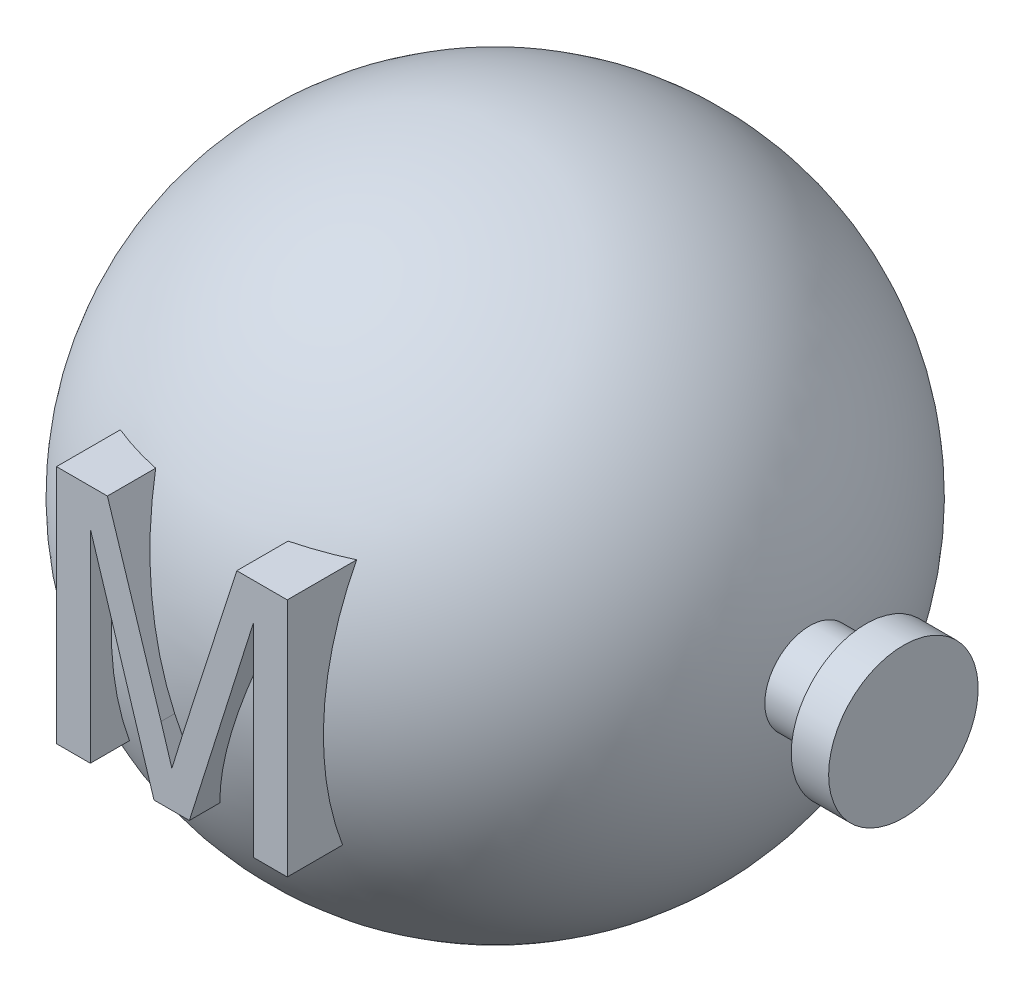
ISO-10303-21;
HEADER;
FILE_DESCRIPTION(('STEP AP214'),'2;1');
FILE_NAME('part.step','',(''),(''),'','','');
FILE_SCHEMA(('AUTOMOTIVE_DESIGN { 1 0 10303 214 1 1 1 1 }'));
ENDSEC;
DATA;
#1=APPLICATION_CONTEXT('core data for automotive mechanical design processes');
#2=APPLICATION_PROTOCOL_DEFINITION('international standard','automotive_design',2000,#1);
#3=PRODUCT_CONTEXT('',#1,'mechanical');
#4=PRODUCT('Part','Part','',(#3));
#5=PRODUCT_RELATED_PRODUCT_CATEGORY('part','',(#4));
#6=PRODUCT_DEFINITION_FORMATION('','',#4);
#7=PRODUCT_DEFINITION_CONTEXT('part definition',#1,'design');
#8=PRODUCT_DEFINITION('design','',#6,#7);
#9=PRODUCT_DEFINITION_SHAPE('','',#8);
#10=(LENGTH_UNIT() NAMED_UNIT(*) SI_UNIT(.MILLI.,.METRE.));
#11=(NAMED_UNIT(*) PLANE_ANGLE_UNIT() SI_UNIT($,.RADIAN.));
#12=(NAMED_UNIT(*) SI_UNIT($,.STERADIAN.) SOLID_ANGLE_UNIT());
#13=UNCERTAINTY_MEASURE_WITH_UNIT(LENGTH_MEASURE(1.E-05),#10,'distance_accuracy_value','');
#14=(GEOMETRIC_REPRESENTATION_CONTEXT(3) GLOBAL_UNCERTAINTY_ASSIGNED_CONTEXT((#13)) GLOBAL_UNIT_ASSIGNED_CONTEXT((#10,
#11,#12)) REPRESENTATION_CONTEXT('',''));
#15=CARTESIAN_POINT('',(0.,0.,0.));
#16=DIRECTION('',(0.,0.,1.));
#17=DIRECTION('',(1.,0.,0.));
#18=AXIS2_PLACEMENT_3D('',#15,#16,#17);
#19=CARTESIAN_POINT('',(0.,0.,0.));
#20=DIRECTION('',(0.,-1.,0.));
#21=DIRECTION('',(-1.,0.,0.));
#22=AXIS2_PLACEMENT_3D('',#19,#20,#21);
#23=SPHERICAL_SURFACE('',#22,85.);
#24=CARTESIAN_POINT('',(-20.1256659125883,0.,0.));
#25=DIRECTION('',(1.,0.,0.));
#26=DIRECTION('',(0.,0.,-1.));
#27=AXIS2_PLACEMENT_3D('',#24,#25,#26);
#28=CIRCLE('',#27,82.5830344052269);
#29=CARTESIAN_POINT('',(-20.1256659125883,26.4211652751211,78.2424411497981));
#30=VERTEX_POINT('',#29);
#31=CARTESIAN_POINT('',(-20.1256659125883,-27.9086530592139,77.7242861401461));
#32=VERTEX_POINT('',#31);
#33=EDGE_CURVE('E40',#30,#32,#28,.T.);
#34=ORIENTED_EDGE('',*,*,#33,.T.);
#35=CARTESIAN_POINT('',(0.,-27.9086530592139,0.));
#36=DIRECTION('',(0.,-1.,0.));
#37=DIRECTION('',(0.,0.,-1.));
#38=AXIS2_PLACEMENT_3D('',#35,#36,#37);
#39=CIRCLE('',#38,80.2876521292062);
#40=CARTESIAN_POINT('',(-29.1806356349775,-27.9086530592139,74.797042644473));
#41=VERTEX_POINT('',#40);
#42=EDGE_CURVE('E11',#32,#41,#39,.T.);
#43=ORIENTED_EDGE('',*,*,#42,.T.);
#44=CARTESIAN_POINT('',(-29.1806356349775,0.,0.));
#45=DIRECTION('',(-1.,0.,0.));
#46=DIRECTION('',(0.,0.,1.));
#47=AXIS2_PLACEMENT_3D('',#44,#45,#46);
#48=CIRCLE('',#47,79.8341437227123);
#49=CARTESIAN_POINT('',(-29.1806356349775,36.299314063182,71.1045026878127));
#50=VERTEX_POINT('',#49);
#51=EDGE_CURVE('E140',#41,#50,#48,.T.);
#52=ORIENTED_EDGE('',*,*,#51,.T.);
#53=CARTESIAN_POINT('',(0.,36.299314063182,0.));
#54=DIRECTION('',(0.,1.,0.));
#55=DIRECTION('',(0.,0.,1.));
#56=AXIS2_PLACEMENT_3D('',#53,#54,#55);
#57=CIRCLE('',#56,76.8593507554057);
#58=CARTESIAN_POINT('',(-15.5595945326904,36.299314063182,75.2679135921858));
#59=VERTEX_POINT('',#58);
#60=EDGE_CURVE('E290',#50,#59,#57,.T.);
#61=ORIENTED_EDGE('',*,*,#60,.T.);
#62=CARTESIAN_POINT('',(-3.62707806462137,-1.15552929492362,0.));
#63=DIRECTION('',(0.95281497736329,0.303551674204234,0.));
#64=DIRECTION('',(-0.303551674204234,0.95281497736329,0.));
#65=AXIS2_PLACEMENT_3D('',#62,#63,#64);
#66=CIRCLE('',#65,84.914716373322);
#67=CARTESIAN_POINT('',(-1.20540957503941,-8.75687760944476,84.5391275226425));
#68=VERTEX_POINT('',#67);
#69=EDGE_CURVE('E198',#59,#68,#66,.T.);
#70=ORIENTED_EDGE('',*,*,#69,.T.);
#71=CARTESIAN_POINT('',(-1.20540957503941,-8.75687760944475,84.5391275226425));
#72=CARTESIAN_POINT('',(-1.1443155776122,-8.95428212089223,84.5195507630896));
#73=CARTESIAN_POINT('',(-1.08324039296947,-9.15161790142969,84.4992163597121));
#74=CARTESIAN_POINT('',(-0.960905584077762,-9.54606919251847,84.457044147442));
#75=CARTESIAN_POINT('',(-0.899645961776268,-9.74318470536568,84.4352063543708));
#76=CARTESIAN_POINT('',(-0.807449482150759,-10.0386376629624,84.4013302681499));
#77=CARTESIAN_POINT('',(-0.776665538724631,-10.1370871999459,84.3898514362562));
#78=CARTESIAN_POINT('',(-0.714961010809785,-10.3338993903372,84.3665225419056));
#79=CARTESIAN_POINT('',(-0.684040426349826,-10.4322620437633,84.3546724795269));
#80=CARTESIAN_POINT('',(-0.591143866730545,-10.7272403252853,84.318562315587));
#81=CARTESIAN_POINT('',(-0.529033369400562,-10.923745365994,84.2937423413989));
#82=CARTESIAN_POINT('',(-0.420344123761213,-11.267760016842,84.2489479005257));
#83=CARTESIAN_POINT('',(-0.373742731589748,-11.415305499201,84.2293027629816));
#84=CARTESIAN_POINT('',(-0.280806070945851,-11.7103632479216,84.1891493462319));
#85=CARTESIAN_POINT('',(-0.234470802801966,-11.8578755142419,84.1686410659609));
#86=CARTESIAN_POINT('',(-0.142161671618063,-12.152890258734,84.1267577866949));
#87=CARTESIAN_POINT('',(-0.0961878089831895,-12.3003927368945,84.1053827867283));
#88=CARTESIAN_POINT('',(-0.00462387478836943,-12.5953884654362,84.0617659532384));
#89=CARTESIAN_POINT('',(0.0409661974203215,-12.7428817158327,84.0395241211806));
#90=CARTESIAN_POINT('',(0.131676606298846,-13.0378796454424,83.9941705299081));
#91=CARTESIAN_POINT('',(0.176796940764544,-13.1853843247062,83.9710587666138));
#92=CARTESIAN_POINT('',(0.266775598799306,-13.4803362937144,83.9239756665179));
#93=CARTESIAN_POINT('',(0.311633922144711,-13.6277835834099,83.9000043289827));
#94=CARTESIAN_POINT('',(0.401416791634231,-13.9225186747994,83.8512174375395));
#95=CARTESIAN_POINT('',(0.446341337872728,-14.0698064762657,83.8264018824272));
#96=CARTESIAN_POINT('',(0.536609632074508,-14.3641118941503,83.7759432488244));
#97=CARTESIAN_POINT('',(0.581953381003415,-14.5111295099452,83.7503001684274));
#98=CARTESIAN_POINT('',(0.672663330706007,-14.8053380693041,83.6981117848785));
#99=CARTESIAN_POINT('',(0.718029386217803,-14.9525287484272,83.6715647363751));
#100=CARTESIAN_POINT('',(0.78560662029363,-15.1733384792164,83.6310870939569));
#101=CARTESIAN_POINT('',(0.808053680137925,-15.2469455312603,83.6174850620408));
#102=CARTESIAN_POINT('',(0.852704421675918,-15.3941919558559,83.590058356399));
#103=CARTESIAN_POINT('',(0.8749081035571,-15.4678313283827,83.5762336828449));
#104=CARTESIAN_POINT('',(0.941245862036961,-15.6887684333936,83.5344301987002));
#105=CARTESIAN_POINT('',(0.985106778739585,-15.8360855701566,83.5061218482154));
#106=CARTESIAN_POINT('',(1.07304460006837,-16.1304931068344,83.4486680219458));
#107=CARTESIAN_POINT('',(1.11712150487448,-16.27758350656,83.4195225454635));
#108=CARTESIAN_POINT('',(1.20636980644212,-16.5712740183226,83.3604341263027));
#109=CARTESIAN_POINT('',(1.25154122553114,-16.7178741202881,83.3304911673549));
#110=CARTESIAN_POINT('',(1.34166186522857,-17.0109653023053,83.2697509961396));
#111=CARTESIAN_POINT('',(1.38661108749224,-17.1574563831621,83.2389537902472));
#112=CARTESIAN_POINT('',(1.45282947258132,-17.3774084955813,83.1920733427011));
#113=CARTESIAN_POINT('',(1.47470101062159,-17.4507605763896,83.1763326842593));
#114=CARTESIAN_POINT('',(1.51809691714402,-17.5975191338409,83.1446258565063));
#115=CARTESIAN_POINT('',(1.53962128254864,-17.67092561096,83.1286596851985));
#116=CARTESIAN_POINT('',(1.58244625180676,-17.817762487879,83.0965060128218));
#117=CARTESIAN_POINT('',(1.6037468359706,-17.8911928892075,83.0803184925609));
#118=CARTESIAN_POINT('',(1.646227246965,-18.0380395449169,83.047728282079));
#119=CARTESIAN_POINT('',(1.6674070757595,-18.111455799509,83.0313255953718));
#120=CARTESIAN_POINT('',(1.68857932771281,-18.1848503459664,83.0148174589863));
#121=B_SPLINE_CURVE_WITH_KNOTS('',3,(#71,#72,#73,#74,#75,#76,#77,#78,#79,#80,#81,#82,#83,#84,
#85,#86,#87,#88,#89,#90,#91,#92,#93,#94,#95,#96,#97,#98,#99,#100,#101,#102,#103,#104,#105,#106,
#107,#108,#109,#110,#111,#112,#113,#114,#115,#116,#117,#118,#119,#120),.UNSPECIFIED.,.F.,.F.,(4,
2,2,2,2,2,2,2,2,2,2,2,2,2,2,2,2,2,2,2,2,2,2,2,4),(0.,0.622702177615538,1.24539780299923,
1.556757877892,1.86811788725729,2.49084077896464,2.95875482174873,3.42666944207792,
3.89458458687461,4.36249894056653,4.83041548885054,5.29833243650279,5.76625005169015,
6.23416874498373,6.70304876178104,6.9374878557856,7.17192676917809,7.64080326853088,
8.10968015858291,8.57856662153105,9.04744958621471,9.28188337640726,9.51631924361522,
9.75077556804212,9.98522806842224),.UNSPECIFIED.);
#122=CARTESIAN_POINT('',(1.68857932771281,-18.1848503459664,83.0148174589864));
#123=VERTEX_POINT('',#122);
#124=EDGE_CURVE('E190',#68,#123,#121,.T.);
#125=ORIENTED_EDGE('',*,*,#124,.T.);
#126=CARTESIAN_POINT('',(1.68857932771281,-18.1848503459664,83.0148174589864));
#127=CARTESIAN_POINT('',(1.72994590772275,-18.044362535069,83.0447506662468));
#128=CARTESIAN_POINT('',(1.77131471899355,-17.9037923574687,83.0742981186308));
#129=CARTESIAN_POINT('',(1.85433311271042,-17.62257202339,83.1325973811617));
#130=CARTESIAN_POINT('',(1.89598269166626,-17.4819218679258,83.1613492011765));
#131=CARTESIAN_POINT('',(1.97983630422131,-17.2006350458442,83.2180313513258));
#132=CARTESIAN_POINT('',(2.02204028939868,-17.0599983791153,83.2459617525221));
#133=CARTESIAN_POINT('',(2.1066432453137,-16.7786294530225,83.3010323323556));
#134=CARTESIAN_POINT('',(2.14904221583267,-16.6378971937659,83.3281725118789));
#135=CARTESIAN_POINT('',(2.21242918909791,-16.4266335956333,83.3683180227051));
#136=CARTESIAN_POINT('',(2.23352220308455,-16.3561873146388,83.3816052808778));
#137=CARTESIAN_POINT('',(2.27557002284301,-16.2152194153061,83.407997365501));
#138=CARTESIAN_POINT('',(2.29652482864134,-16.1446977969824,83.4211021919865));
#139=CARTESIAN_POINT('',(2.35929108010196,-15.9330506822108,83.4601340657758));
#140=CARTESIAN_POINT('',(2.40100413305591,-15.7918436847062,83.4857783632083));
#141=CARTESIAN_POINT('',(2.46398574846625,-15.5800437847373,83.5236289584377));
#142=CARTESIAN_POINT('',(2.48504854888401,-15.5094447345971,83.5361433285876));
#143=CARTESIAN_POINT('',(2.52740362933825,-15.3682780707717,83.5609588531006));
#144=CARTESIAN_POINT('',(2.54869590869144,-15.2977104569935,83.5732600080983));
#145=CARTESIAN_POINT('',(2.59162784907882,-15.1566432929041,83.5976388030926));
#146=CARTESIAN_POINT('',(2.61326750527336,-15.0861437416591,83.6097164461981));
#147=CARTESIAN_POINT('',(2.65689628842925,-14.9452147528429,83.6336477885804));
#148=CARTESIAN_POINT('',(2.67888541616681,-14.8747853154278,83.6455014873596));
#149=CARTESIAN_POINT('',(2.74521425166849,-14.6635589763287,83.6807395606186));
#150=CARTESIAN_POINT('',(2.78991600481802,-14.5228221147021,83.7038012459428));
#151=CARTESIAN_POINT('',(2.87959670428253,-14.2413061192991,83.7491221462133));
#152=CARTESIAN_POINT('',(2.92457565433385,-14.1005269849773,83.7713813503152));
#153=CARTESIAN_POINT('',(3.01402921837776,-13.8186990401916,83.8151628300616));
#154=CARTESIAN_POINT('',(3.0585038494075,-13.6776502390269,83.8366851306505));
#155=CARTESIAN_POINT('',(3.14694500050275,-13.395283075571,83.8789929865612));
#156=CARTESIAN_POINT('',(3.19091151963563,-13.2539647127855,83.8997785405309));
#157=CARTESIAN_POINT('',(3.30053355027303,-12.8995628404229,83.9509284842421));
#158=CARTESIAN_POINT('',(3.36591395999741,-12.686326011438,83.9808215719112));
#159=CARTESIAN_POINT('',(3.49607949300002,-12.2594393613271,84.0388851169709));
#160=CARTESIAN_POINT('',(3.56086462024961,-12.045789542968,84.067055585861));
#161=CARTESIAN_POINT('',(3.69120295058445,-11.6184901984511,84.1215569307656));
#162=CARTESIAN_POINT('',(3.75675614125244,-11.4048406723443,84.1478878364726));
#163=CARTESIAN_POINT('',(3.89001928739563,-10.9779811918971,84.1985885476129));
#164=CARTESIAN_POINT('',(3.95772924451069,-10.7647712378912,84.2229583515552));
#165=CARTESIAN_POINT('',(4.07143586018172,-10.4093634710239,84.2620383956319));
#166=CARTESIAN_POINT('',(4.11716336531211,-10.2671351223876,84.2772653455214));
#167=CARTESIAN_POINT('',(4.20865314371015,-9.98260592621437,84.3069236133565));
#168=CARTESIAN_POINT('',(4.25441541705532,-9.8403050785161,84.3213549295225));
#169=CARTESIAN_POINT('',(4.34554549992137,-9.55550224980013,84.3494585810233));
#170=CARTESIAN_POINT('',(4.39091330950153,-9.41300026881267,84.3631309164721));
#171=CARTESIAN_POINT('',(4.48129521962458,-9.12780887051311,84.3897129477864));
#172=CARTESIAN_POINT('',(4.52630931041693,-8.98511944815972,84.4026226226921));
#173=CARTESIAN_POINT('',(4.61612098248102,-8.69960342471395,84.4276665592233));
#174=CARTESIAN_POINT('',(4.66091856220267,-8.55677682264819,84.4398008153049));
#175=CARTESIAN_POINT('',(4.75041245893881,-8.27102535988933,84.4632835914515));
#176=CARTESIAN_POINT('',(4.795108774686,-8.12810049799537,84.4746321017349));
#177=CARTESIAN_POINT('',(4.83981168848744,-7.98514723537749,84.4855824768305));
#178=B_SPLINE_CURVE_WITH_KNOTS('',3,(#126,#127,#128,#129,#130,#131,#132,#133,#134,#135,#136,
#137,#138,#139,#140,#141,#142,#143,#144,#145,#146,#147,#148,#149,#150,#151,#152,#153,#154,#155,
#156,#157,#158,#159,#160,#161,#162,#163,#164,#165,#166,#167,#168,#169,#170,#171,#172,#173,#174,
#175,#176,#177),.UNSPECIFIED.,.F.,.F.,(4,2,2,2,2,2,2,2,2,2,2,2,2,2,2,2,2,2,2,2,2,2,2,2,2,4),(0.,
0.448438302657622,0.89687104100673,1.34526487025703,1.79365819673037,2.01783926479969,
2.24202028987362,2.69038475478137,2.91457238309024,3.13875934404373,3.36294318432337,
3.58712752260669,4.03549005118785,4.48385863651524,4.93221202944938,5.38056624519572,
6.05564448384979,6.73071821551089,7.4057810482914,8.08084439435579,8.53136042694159,
8.98187746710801,9.4323944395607,9.88292378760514,10.3334563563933,10.7839945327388),.UNSPECIFIED.);
#179=CARTESIAN_POINT('',(4.83981168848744,-7.98514723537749,84.4855824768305));
#180=VERTEX_POINT('',#179);
#181=EDGE_CURVE('E197',#123,#180,#178,.T.);
#182=ORIENTED_EDGE('',*,*,#181,.T.);
#183=CARTESIAN_POINT('',(6.71128920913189,-2.1539281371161,0.));
#184=DIRECTION('',(-0.952163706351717,0.305588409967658,0.));
#185=DIRECTION('',(-0.305588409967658,-0.952163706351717,0.));
#186=AXIS2_PLACEMENT_3D('',#183,#184,#185);
#187=CIRCLE('',#186,84.7072558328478);
#188=CARTESIAN_POINT('',(19.0525127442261,36.299314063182,74.4604697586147));
#189=VERTEX_POINT('',#188);
#190=EDGE_CURVE('E205',#180,#189,#187,.T.);
#191=ORIENTED_EDGE('',*,*,#190,.T.);
#192=CARTESIAN_POINT('',(0.,36.299314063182,0.));
#193=DIRECTION('',(0.,1.,0.));
#194=DIRECTION('',(0.,0.,1.));
#195=AXIS2_PLACEMENT_3D('',#192,#193,#194);
#196=CIRCLE('',#195,76.8593507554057);
#197=CARTESIAN_POINT('',(32.5577942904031,36.299314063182,69.6229116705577));
#198=VERTEX_POINT('',#197);
#199=EDGE_CURVE('E208',#189,#198,#196,.T.);
#200=ORIENTED_EDGE('',*,*,#199,.T.);
#201=CARTESIAN_POINT('',(32.5577942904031,0.,0.));
#202=DIRECTION('',(1.,0.,0.));
#203=DIRECTION('',(0.,0.,-1.));
#204=AXIS2_PLACEMENT_3D('',#201,#202,#203);
#205=CIRCLE('',#204,78.517450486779);
#206=CARTESIAN_POINT('',(32.5577942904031,-27.9086530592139,73.3900341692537));
#207=VERTEX_POINT('',#206);
#208=EDGE_CURVE('E211',#198,#207,#205,.T.);
#209=ORIENTED_EDGE('',*,*,#208,.T.);
#210=CARTESIAN_POINT('',(0.,-27.9086530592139,0.));
#211=DIRECTION('',(0.,-1.,0.));
#212=DIRECTION('',(0.,0.,-1.));
#213=AXIS2_PLACEMENT_3D('',#210,#211,#212);
#214=CIRCLE('',#213,80.2876521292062);
#215=CARTESIAN_POINT('',(23.502824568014,-27.9086530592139,76.7705954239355));
#216=VERTEX_POINT('',#215);
#217=EDGE_CURVE('E214',#207,#216,#214,.T.);
#218=ORIENTED_EDGE('',*,*,#217,.T.);
#219=CARTESIAN_POINT('',(23.502824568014,0.,0.));
#220=DIRECTION('',(-1.,0.,0.));
#221=DIRECTION('',(0.,0.,1.));
#222=AXIS2_PLACEMENT_3D('',#219,#220,#221);
#223=CIRCLE('',#222,81.6860896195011);
#224=CARTESIAN_POINT('',(23.502824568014,26.4211652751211,77.2951438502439));
#225=VERTEX_POINT('',#224);
#226=EDGE_CURVE('E217',#216,#225,#223,.T.);
#227=ORIENTED_EDGE('',*,*,#226,.T.);
#228=CARTESIAN_POINT('',(13.7989811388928,-4.35138325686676,0.));
#229=DIRECTION('',(0.953705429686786,-0.300742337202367,0.));
#230=DIRECTION('',(0.300742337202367,0.953705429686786,0.));
#231=AXIS2_PLACEMENT_3D('',#228,#229,#230);
#232=CIRCLE('',#231,83.7594984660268);
#233=CARTESIAN_POINT('',(6.37041026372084,-27.9086530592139,80.0345235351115));
#234=VERTEX_POINT('',#233);
#235=EDGE_CURVE('E220',#225,#234,#232,.T.);
#236=ORIENTED_EDGE('',*,*,#235,.T.);
#237=CARTESIAN_POINT('',(0.,-27.9086530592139,0.));
#238=DIRECTION('',(0.,-1.,0.));
#239=DIRECTION('',(0.,0.,-1.));
#240=AXIS2_PLACEMENT_3D('',#237,#238,#239);
#241=CIRCLE('',#240,80.2876521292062);
#242=CARTESIAN_POINT('',(-3.09614899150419,-27.9086530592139,80.2279312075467));
#243=VERTEX_POINT('',#242);
#244=EDGE_CURVE('E223',#234,#243,#241,.T.);
#245=ORIENTED_EDGE('',*,*,#244,.T.);
#246=CARTESIAN_POINT('',(-10.7844684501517,-3.38035895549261,0.));
#247=DIRECTION('',(-0.954222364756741,-0.299098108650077,0.));
#248=DIRECTION('',(0.299098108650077,-0.954222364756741,0.));
#249=AXIS2_PLACEMENT_3D('',#246,#247,#248);
#250=CIRCLE('',#249,84.2452871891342);
#251=EDGE_CURVE('E226',#243,#30,#250,.T.);
#252=ORIENTED_EDGE('',*,*,#251,.T.);
#253=EDGE_LOOP('',(#34,#43,#52,#61,#70,#125,#182,#191,#200,#209,#218,#227,#236,#245,#252));
#254=FACE_BOUND('',#253,.T.);
#255=CARTESIAN_POINT('',(84.1486779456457,0.,0.));
#256=DIRECTION('',(-1.,0.,0.));
#257=DIRECTION('',(0.,0.,1.));
#258=AXIS2_PLACEMENT_3D('',#255,#256,#257);
#259=CIRCLE('',#258,12.);
#260=CARTESIAN_POINT('',(84.1486779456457,0.,12.));
#261=VERTEX_POINT('',#260);
#262=EDGE_CURVE('E287',#261,#261,#259,.F.);
#263=ORIENTED_EDGE('',*,*,#262,.F.);
#264=EDGE_LOOP('',(#263));
#265=FACE_BOUND('',#264,.T.);
#266=ADVANCED_FACE('F32',(#254,#265),#23,.T.);
#267=CARTESIAN_POINT('',(0.,0.,0.));
#268=DIRECTION('',(-1.,0.,0.));
#269=DIRECTION('',(0.,0.,1.));
#270=AXIS2_PLACEMENT_3D('',#267,#268,#269);
#271=CYLINDRICAL_SURFACE('',#270,12.);
#272=CARTESIAN_POINT('',(99.2135729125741,0.,0.));
#273=DIRECTION('',(-1.,0.,0.));
#274=DIRECTION('',(0.,0.,1.));
#275=AXIS2_PLACEMENT_3D('',#272,#273,#274);
#276=CIRCLE('',#275,12.);
#277=CARTESIAN_POINT('',(99.2135729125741,0.,12.));
#278=VERTEX_POINT('',#277);
#279=EDGE_CURVE('E243',#278,#278,#276,.T.);
#280=ORIENTED_EDGE('',*,*,#279,.T.);
#281=EDGE_LOOP('',(#280));
#282=FACE_BOUND('',#281,.T.);
#283=ORIENTED_EDGE('',*,*,#262,.T.);
#284=EDGE_LOOP('',(#283));
#285=FACE_BOUND('',#284,.T.);
#286=ADVANCED_FACE('F303',(#282,#285),#271,.T.);
#287=CARTESIAN_POINT('',(109.213572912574,20.,0.));
#288=DIRECTION('',(-1.,0.,0.));
#289=DIRECTION('',(0.,0.,1.));
#290=AXIS2_PLACEMENT_3D('',#287,#288,#289);
#291=PLANE('',#290);
#292=CARTESIAN_POINT('',(109.213572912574,0.,0.));
#293=DIRECTION('',(-1.,0.,0.));
#294=DIRECTION('',(0.,0.,1.));
#295=AXIS2_PLACEMENT_3D('',#292,#293,#294);
#296=CIRCLE('',#295,20.);
#297=CARTESIAN_POINT('',(109.213572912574,0.,20.));
#298=VERTEX_POINT('',#297);
#299=EDGE_CURVE('E284',#298,#298,#296,.T.);
#300=ORIENTED_EDGE('',*,*,#299,.F.);
#301=EDGE_LOOP('',(#300));
#302=FACE_BOUND('',#301,.T.);
#303=ADVANCED_FACE('F307',(#302),#291,.F.);
#304=CARTESIAN_POINT('',(0.,0.,0.));
#305=DIRECTION('',(-1.,0.,0.));
#306=DIRECTION('',(0.,0.,1.));
#307=AXIS2_PLACEMENT_3D('',#304,#305,#306);
#308=CYLINDRICAL_SURFACE('',#307,20.);
#309=CARTESIAN_POINT('',(99.2135729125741,0.,0.));
#310=DIRECTION('',(-1.,0.,0.));
#311=DIRECTION('',(0.,0.,1.));
#312=AXIS2_PLACEMENT_3D('',#309,#310,#311);
#313=CIRCLE('',#312,20.);
#314=CARTESIAN_POINT('',(99.2135729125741,0.,20.));
#315=VERTEX_POINT('',#314);
#316=EDGE_CURVE('E281',#315,#315,#313,.T.);
#317=ORIENTED_EDGE('',*,*,#316,.F.);
#318=EDGE_LOOP('',(#317));
#319=FACE_BOUND('',#318,.T.);
#320=ORIENTED_EDGE('',*,*,#299,.T.);
#321=EDGE_LOOP('',(#320));
#322=FACE_BOUND('',#321,.T.);
#323=ADVANCED_FACE('F313',(#319,#322),#308,.T.);
#324=CARTESIAN_POINT('',(99.2135729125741,12.,0.));
#325=DIRECTION('',(1.,0.,0.));
#326=DIRECTION('',(0.,0.,-1.));
#327=AXIS2_PLACEMENT_3D('',#324,#325,#326);
#328=PLANE('',#327);
#329=ORIENTED_EDGE('',*,*,#279,.F.);
#330=EDGE_LOOP('',(#329));
#331=FACE_BOUND('',#330,.T.);
#332=ORIENTED_EDGE('',*,*,#316,.T.);
#333=EDGE_LOOP('',(#332));
#334=FACE_BOUND('',#333,.T.);
#335=ADVANCED_FACE('F318',(#331,#334),#328,.F.);
#336=CARTESIAN_POINT('',(-20.1256659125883,-27.9086530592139,88.1865879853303));
#337=DIRECTION('',(0.,-1.,0.));
#338=DIRECTION('',(0.,0.,-1.));
#339=AXIS2_PLACEMENT_3D('',#336,#337,#338);
#340=PLANE('',#339);
#341=ORIENTED_EDGE('',*,*,#42,.F.);
#342=DIRECTION('',(0.,0.,-1.));
#343=VECTOR('',#342,1.);
#344=CARTESIAN_POINT('',(-20.1256659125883,-27.9086530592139,88.1865879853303));
#345=LINE('',#344,#343);
#346=CARTESIAN_POINT('',(-20.1256659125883,-27.9086530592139,88.1865879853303));
#347=VERTEX_POINT('',#346);
#348=EDGE_CURVE('E156',#347,#32,#345,.T.);
#349=ORIENTED_EDGE('',*,*,#348,.F.);
#350=DIRECTION('',(-1.,0.,0.));
#351=VECTOR('',#350,1.);
#352=CARTESIAN_POINT('',(-20.1256659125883,-27.9086530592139,88.1865879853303));
#353=LINE('',#352,#351);
#354=CARTESIAN_POINT('',(-29.1806356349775,-27.9086530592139,88.1865879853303));
#355=VERTEX_POINT('',#354);
#356=EDGE_CURVE('E149',#347,#355,#353,.T.);
#357=ORIENTED_EDGE('',*,*,#356,.T.);
#358=DIRECTION('',(0.,0.,-1.));
#359=VECTOR('',#358,1.);
#360=CARTESIAN_POINT('',(-29.1806356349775,-27.9086530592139,88.1865879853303));
#361=LINE('',#360,#359);
#362=EDGE_CURVE('E135',#355,#41,#361,.T.);
#363=ORIENTED_EDGE('',*,*,#362,.T.);
#364=EDGE_LOOP('',(#341,#349,#357,#363));
#365=FACE_BOUND('',#364,.T.);
#366=ADVANCED_FACE('F155',(#365),#340,.T.);
#367=CARTESIAN_POINT('',(-20.1256659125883,26.4211652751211,88.1865879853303));
#368=DIRECTION('',(1.,0.,0.));
#369=DIRECTION('',(0.,0.,-1.));
#370=AXIS2_PLACEMENT_3D('',#367,#368,#369);
#371=PLANE('',#370);
#372=ORIENTED_EDGE('',*,*,#33,.F.);
#373=DIRECTION('',(0.,0.,-1.));
#374=VECTOR('',#373,1.);
#375=CARTESIAN_POINT('',(-20.1256659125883,26.4211652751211,88.1865879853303));
#376=LINE('',#375,#374);
#377=CARTESIAN_POINT('',(-20.1256659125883,26.4211652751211,88.1865879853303));
#378=VERTEX_POINT('',#377);
#379=EDGE_CURVE('E234',#378,#30,#376,.T.);
#380=ORIENTED_EDGE('',*,*,#379,.F.);
#381=DIRECTION('',(0.,-1.,0.));
#382=VECTOR('',#381,1.);
#383=CARTESIAN_POINT('',(-20.1256659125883,26.4211652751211,88.1865879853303));
#384=LINE('',#383,#382);
#385=EDGE_CURVE('E142',#378,#347,#384,.T.);
#386=ORIENTED_EDGE('',*,*,#385,.T.);
#387=ORIENTED_EDGE('',*,*,#348,.T.);
#388=EDGE_LOOP('',(#372,#380,#386,#387));
#389=FACE_BOUND('',#388,.T.);
#390=ADVANCED_FACE('F233',(#389),#371,.T.);
#391=CARTESIAN_POINT('',(-3.09614899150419,-27.9086530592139,88.1865879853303));
#392=DIRECTION('',(-0.954222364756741,-0.299098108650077,0.));
#393=DIRECTION('',(0.299098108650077,-0.954222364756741,0.));
#394=AXIS2_PLACEMENT_3D('',#391,#392,#393);
#395=PLANE('',#394);
#396=ORIENTED_EDGE('',*,*,#251,.F.);
#397=DIRECTION('',(0.,0.,-1.));
#398=VECTOR('',#397,1.);
#399=CARTESIAN_POINT('',(-3.09614899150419,-27.9086530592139,88.1865879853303));
#400=LINE('',#399,#398);
#401=CARTESIAN_POINT('',(-3.09614899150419,-27.9086530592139,88.1865879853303));
#402=VERTEX_POINT('',#401);
#403=EDGE_CURVE('E241',#402,#243,#400,.T.);
#404=ORIENTED_EDGE('',*,*,#403,.F.);
#405=DIRECTION('',(-0.299098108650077,0.954222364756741,0.));
#406=VECTOR('',#405,1.);
#407=CARTESIAN_POINT('',(-3.09614899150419,-27.9086530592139,88.1865879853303));
#408=LINE('',#407,#406);
#409=EDGE_CURVE('E240',#402,#378,#408,.T.);
#410=ORIENTED_EDGE('',*,*,#409,.T.);
#411=ORIENTED_EDGE('',*,*,#379,.T.);
#412=EDGE_LOOP('',(#396,#404,#410,#411));
#413=FACE_BOUND('',#412,.T.);
#414=ADVANCED_FACE('F237',(#413),#395,.T.);
#415=CARTESIAN_POINT('',(6.37041026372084,-27.9086530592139,88.1865879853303));
#416=DIRECTION('',(0.,-1.,0.));
#417=DIRECTION('',(0.,0.,-1.));
#418=AXIS2_PLACEMENT_3D('',#415,#416,#417);
#419=PLANE('',#418);
#420=ORIENTED_EDGE('',*,*,#244,.F.);
#421=DIRECTION('',(0.,0.,-1.));
#422=VECTOR('',#421,1.);
#423=CARTESIAN_POINT('',(6.37041026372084,-27.9086530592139,88.1865879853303));
#424=LINE('',#423,#422);
#425=CARTESIAN_POINT('',(6.37041026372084,-27.9086530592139,88.1865879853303));
#426=VERTEX_POINT('',#425);
#427=EDGE_CURVE('E245',#426,#234,#424,.T.);
#428=ORIENTED_EDGE('',*,*,#427,.F.);
#429=DIRECTION('',(-1.,0.,0.));
#430=VECTOR('',#429,1.);
#431=CARTESIAN_POINT('',(6.37041026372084,-27.9086530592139,88.1865879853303));
#432=LINE('',#431,#430);
#433=EDGE_CURVE('E507',#426,#402,#432,.T.);
#434=ORIENTED_EDGE('',*,*,#433,.T.);
#435=ORIENTED_EDGE('',*,*,#403,.T.);
#436=EDGE_LOOP('',(#420,#428,#434,#435));
#437=FACE_BOUND('',#436,.T.);
#438=ADVANCED_FACE('F353',(#437),#419,.T.);
#439=CARTESIAN_POINT('',(23.502824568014,26.4211652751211,88.1865879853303));
#440=DIRECTION('',(0.953705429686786,-0.300742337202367,0.));
#441=DIRECTION('',(0.300742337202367,0.953705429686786,0.));
#442=AXIS2_PLACEMENT_3D('',#439,#440,#441);
#443=PLANE('',#442);
#444=ORIENTED_EDGE('',*,*,#235,.F.);
#445=DIRECTION('',(0.,0.,-1.));
#446=VECTOR('',#445,1.);
#447=CARTESIAN_POINT('',(23.502824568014,26.4211652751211,88.1865879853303));
#448=LINE('',#447,#446);
#449=CARTESIAN_POINT('',(23.502824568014,26.4211652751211,88.1865879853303));
#450=VERTEX_POINT('',#449);
#451=EDGE_CURVE('E251',#450,#225,#448,.T.);
#452=ORIENTED_EDGE('',*,*,#451,.F.);
#453=DIRECTION('',(-0.300742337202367,-0.953705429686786,0.));
#454=VECTOR('',#453,1.);
#455=CARTESIAN_POINT('',(23.502824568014,26.4211652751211,88.1865879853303));
#456=LINE('',#455,#454);
#457=EDGE_CURVE('E504',#450,#426,#456,.T.);
#458=ORIENTED_EDGE('',*,*,#457,.T.);
#459=ORIENTED_EDGE('',*,*,#427,.T.);
#460=EDGE_LOOP('',(#444,#452,#458,#459));
#461=FACE_BOUND('',#460,.T.);
#462=ADVANCED_FACE('F360',(#461),#443,.T.);
#463=CARTESIAN_POINT('',(23.502824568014,-27.9086530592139,88.1865879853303));
#464=DIRECTION('',(-1.,0.,0.));
#465=DIRECTION('',(0.,0.,1.));
#466=AXIS2_PLACEMENT_3D('',#463,#464,#465);
#467=PLANE('',#466);
#468=ORIENTED_EDGE('',*,*,#226,.F.);
#469=DIRECTION('',(0.,0.,-1.));
#470=VECTOR('',#469,1.);
#471=CARTESIAN_POINT('',(23.502824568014,-27.9086530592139,88.1865879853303));
#472=LINE('',#471,#470);
#473=CARTESIAN_POINT('',(23.502824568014,-27.9086530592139,88.1865879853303));
#474=VERTEX_POINT('',#473);
#475=EDGE_CURVE('E254',#474,#216,#472,.T.);
#476=ORIENTED_EDGE('',*,*,#475,.F.);
#477=DIRECTION('',(0.,1.,0.));
#478=VECTOR('',#477,1.);
#479=CARTESIAN_POINT('',(23.502824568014,-27.9086530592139,88.1865879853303));
#480=LINE('',#479,#478);
#481=EDGE_CURVE('E501',#474,#450,#480,.T.);
#482=ORIENTED_EDGE('',*,*,#481,.T.);
#483=ORIENTED_EDGE('',*,*,#451,.T.);
#484=EDGE_LOOP('',(#468,#476,#482,#483));
#485=FACE_BOUND('',#484,.T.);
#486=ADVANCED_FACE('F368',(#485),#467,.T.);
#487=CARTESIAN_POINT('',(32.5577942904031,-27.9086530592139,88.1865879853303));
#488=DIRECTION('',(0.,-1.,0.));
#489=DIRECTION('',(0.,0.,-1.));
#490=AXIS2_PLACEMENT_3D('',#487,#488,#489);
#491=PLANE('',#490);
#492=ORIENTED_EDGE('',*,*,#217,.F.);
#493=DIRECTION('',(0.,0.,-1.));
#494=VECTOR('',#493,1.);
#495=CARTESIAN_POINT('',(32.5577942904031,-27.9086530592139,88.1865879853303));
#496=LINE('',#495,#494);
#497=CARTESIAN_POINT('',(32.5577942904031,-27.9086530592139,88.1865879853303));
#498=VERTEX_POINT('',#497);
#499=EDGE_CURVE('E257',#498,#207,#496,.T.);
#500=ORIENTED_EDGE('',*,*,#499,.F.);
#501=DIRECTION('',(-1.,0.,0.));
#502=VECTOR('',#501,1.);
#503=CARTESIAN_POINT('',(32.5577942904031,-27.9086530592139,88.1865879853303));
#504=LINE('',#503,#502);
#505=EDGE_CURVE('E498',#498,#474,#504,.T.);
#506=ORIENTED_EDGE('',*,*,#505,.T.);
#507=ORIENTED_EDGE('',*,*,#475,.T.);
#508=EDGE_LOOP('',(#492,#500,#506,#507));
#509=FACE_BOUND('',#508,.T.);
#510=ADVANCED_FACE('F376',(#509),#491,.T.);
#511=CARTESIAN_POINT('',(32.5577942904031,36.299314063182,88.1865879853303));
#512=DIRECTION('',(1.,0.,0.));
#513=DIRECTION('',(0.,0.,-1.));
#514=AXIS2_PLACEMENT_3D('',#511,#512,#513);
#515=PLANE('',#514);
#516=ORIENTED_EDGE('',*,*,#208,.F.);
#517=DIRECTION('',(0.,0.,-1.));
#518=VECTOR('',#517,1.);
#519=CARTESIAN_POINT('',(32.5577942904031,36.299314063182,88.1865879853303));
#520=LINE('',#519,#518);
#521=CARTESIAN_POINT('',(32.5577942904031,36.299314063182,88.1865879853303));
#522=VERTEX_POINT('',#521);
#523=EDGE_CURVE('E260',#522,#198,#520,.T.);
#524=ORIENTED_EDGE('',*,*,#523,.F.);
#525=DIRECTION('',(0.,-1.,0.));
#526=VECTOR('',#525,1.);
#527=CARTESIAN_POINT('',(32.5577942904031,36.299314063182,88.1865879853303));
#528=LINE('',#527,#526);
#529=EDGE_CURVE('E493',#522,#498,#528,.T.);
#530=ORIENTED_EDGE('',*,*,#529,.T.);
#531=ORIENTED_EDGE('',*,*,#499,.T.);
#532=EDGE_LOOP('',(#516,#524,#530,#531));
#533=FACE_BOUND('',#532,.T.);
#534=ADVANCED_FACE('F384',(#533),#515,.T.);
#535=CARTESIAN_POINT('',(19.0525127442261,36.299314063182,88.1865879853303));
#536=DIRECTION('',(0.,1.,0.));
#537=DIRECTION('',(0.,0.,1.));
#538=AXIS2_PLACEMENT_3D('',#535,#536,#537);
#539=PLANE('',#538);
#540=ORIENTED_EDGE('',*,*,#199,.F.);
#541=DIRECTION('',(0.,0.,-1.));
#542=VECTOR('',#541,1.);
#543=CARTESIAN_POINT('',(19.0525127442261,36.299314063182,88.1865879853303));
#544=LINE('',#543,#542);
#545=CARTESIAN_POINT('',(19.0525127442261,36.299314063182,88.1865879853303));
#546=VERTEX_POINT('',#545);
#547=EDGE_CURVE('E263',#546,#189,#544,.T.);
#548=ORIENTED_EDGE('',*,*,#547,.F.);
#549=DIRECTION('',(1.,0.,0.));
#550=VECTOR('',#549,1.);
#551=CARTESIAN_POINT('',(19.0525127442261,36.299314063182,88.1865879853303));
#552=LINE('',#551,#550);
#553=EDGE_CURVE('E491',#546,#522,#552,.T.);
#554=ORIENTED_EDGE('',*,*,#553,.T.);
#555=ORIENTED_EDGE('',*,*,#523,.T.);
#556=EDGE_LOOP('',(#540,#548,#554,#555));
#557=FACE_BOUND('',#556,.T.);
#558=ADVANCED_FACE('F392',(#557),#539,.T.);
#559=CARTESIAN_POINT('',(4.83981168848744,-7.98514723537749,88.1865879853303));
#560=DIRECTION('',(-0.952163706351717,0.305588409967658,0.));
#561=DIRECTION('',(-0.305588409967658,-0.952163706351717,0.));
#562=AXIS2_PLACEMENT_3D('',#559,#560,#561);
#563=PLANE('',#562);
#564=ORIENTED_EDGE('',*,*,#190,.F.);
#565=DIRECTION('',(0.,0.,-1.));
#566=VECTOR('',#565,1.);
#567=CARTESIAN_POINT('',(4.83981168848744,-7.98514723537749,88.1865879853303));
#568=LINE('',#567,#566);
#569=CARTESIAN_POINT('',(4.83981168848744,-7.98514723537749,88.1865879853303));
#570=VERTEX_POINT('',#569);
#571=EDGE_CURVE('E266',#570,#180,#568,.T.);
#572=ORIENTED_EDGE('',*,*,#571,.F.);
#573=DIRECTION('',(0.305588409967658,0.952163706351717,0.));
#574=VECTOR('',#573,1.);
#575=CARTESIAN_POINT('',(4.83981168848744,-7.98514723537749,88.1865879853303));
#576=LINE('',#575,#574);
#577=EDGE_CURVE('E490',#570,#546,#576,.T.);
#578=ORIENTED_EDGE('',*,*,#577,.T.);
#579=ORIENTED_EDGE('',*,*,#547,.T.);
#580=EDGE_LOOP('',(#564,#572,#578,#579));
#581=FACE_BOUND('',#580,.T.);
#582=ADVANCED_FACE('F400',(#581),#563,.T.);
#583=CARTESIAN_POINT('',(1.68857932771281,-18.1848503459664,88.1865879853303));
#584=CARTESIAN_POINT('',(1.77821487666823,-17.8803257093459,88.1865879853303));
#585=CARTESIAN_POINT('',(1.96896505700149,-17.2322778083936,88.1865879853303));
#586=CARTESIAN_POINT('',(2.27820159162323,-16.2133335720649,88.1865879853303));
#587=CARTESIAN_POINT('',(2.60723806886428,-15.0857571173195,88.1865879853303));
#588=CARTESIAN_POINT('',(3.00099387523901,-13.8689296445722,88.1865879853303));
#589=CARTESIAN_POINT('',(3.41143770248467,-12.5437629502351,88.1865879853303));
#590=CARTESIAN_POINT('',(3.84225191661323,-11.1113575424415,88.1865879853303));
#591=CARTESIAN_POINT('',(4.33918772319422,-9.58601427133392,88.1865879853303));
#592=CARTESIAN_POINT('',(4.66942640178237,-8.52999568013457,88.1865879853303));
#593=CARTESIAN_POINT('',(4.83981168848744,-7.98514723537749,88.1865879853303));
#594=B_SPLINE_CURVE_WITH_KNOTS('',3,(#583,#584,#585,#586,#587,#588,#589,#590,#591,#592,#593),
.UNSPECIFIED.,.F.,.F.,(4,1,1,1,1,1,1,1,4),(0.,0.0892047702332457,0.189833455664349,
0.299232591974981,0.419260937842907,0.549207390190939,0.689074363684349,0.839579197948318,1.),.UNSPECIFIED.);
#595=DIRECTION('',(0.,0.,-1.));
#596=VECTOR('',#595,1.);
#597=SURFACE_OF_LINEAR_EXTRUSION('',#594,#596);
#598=ORIENTED_EDGE('',*,*,#181,.F.);
#599=DIRECTION('',(0.,0.,-1.));
#600=VECTOR('',#599,1.);
#601=CARTESIAN_POINT('',(1.68857932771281,-18.1848503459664,88.1865879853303));
#602=LINE('',#601,#600);
#603=CARTESIAN_POINT('',(1.68857932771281,-18.1848503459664,88.1865879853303));
#604=VERTEX_POINT('',#603);
#605=EDGE_CURVE('E269',#604,#123,#602,.T.);
#606=ORIENTED_EDGE('',*,*,#605,.F.);
#607=EDGE_CURVE('E169',#604,#570,#594,.T.);
#608=ORIENTED_EDGE('',*,*,#607,.T.);
#609=ORIENTED_EDGE('',*,*,#571,.T.);
#610=EDGE_LOOP('',(#598,#606,#608,#609));
#611=FACE_BOUND('',#610,.T.);
#612=ADVANCED_FACE('F184',(#611),#597,.T.);
#613=CARTESIAN_POINT('',(-1.20540957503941,-8.75687760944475,88.1865879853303));
#614=CARTESIAN_POINT('',(-1.04744115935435,-9.26728573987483,88.1865879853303));
#615=CARTESIAN_POINT('',(-0.741939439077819,-10.2543853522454,88.1865879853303));
#616=CARTESIAN_POINT('',(-0.288916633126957,-11.6798480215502,88.1865879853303));
#617=CARTESIAN_POINT('',(0.12325817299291,-13.0044960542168,88.1865879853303));
#618=CARTESIAN_POINT('',(0.494486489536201,-14.2325458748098,88.1865879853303));
#619=CARTESIAN_POINT('',(0.844819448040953,-15.357900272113,88.1865879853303));
#620=CARTESIAN_POINT('',(1.14815258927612,-16.3897936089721,88.1865879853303));
#621=CARTESIAN_POINT('',(1.43814894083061,-17.3167592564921,88.1865879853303));
#622=CARTESIAN_POINT('',(1.60809976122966,-17.9058762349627,88.1865879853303));
#623=CARTESIAN_POINT('',(1.68857932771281,-18.1848503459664,88.1865879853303));
#624=B_SPLINE_CURVE_WITH_KNOTS('',3,(#613,#614,#615,#616,#617,#618,#619,#620,#621,#622,#623),
.UNSPECIFIED.,.F.,.F.,(4,1,1,1,1,1,1,1,4),(0.,0.162525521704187,0.314314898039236,
0.454978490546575,0.584519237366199,0.704567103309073,0.813494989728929,0.911681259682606,1.),.UNSPECIFIED.);
#625=DIRECTION('',(0.,0.,-1.));
#626=VECTOR('',#625,1.);
#627=SURFACE_OF_LINEAR_EXTRUSION('',#624,#626);
#628=ORIENTED_EDGE('',*,*,#124,.F.);
#629=DIRECTION('',(0.,0.,-1.));
#630=VECTOR('',#629,1.);
#631=CARTESIAN_POINT('',(-1.20540957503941,-8.75687760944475,88.1865879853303));
#632=LINE('',#631,#630);
#633=CARTESIAN_POINT('',(-1.20540957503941,-8.75687760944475,88.1865879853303));
#634=VERTEX_POINT('',#633);
#635=EDGE_CURVE('E272',#634,#68,#632,.T.);
#636=ORIENTED_EDGE('',*,*,#635,.F.);
#637=EDGE_CURVE('E163',#634,#604,#624,.T.);
#638=ORIENTED_EDGE('',*,*,#637,.T.);
#639=ORIENTED_EDGE('',*,*,#605,.T.);
#640=EDGE_LOOP('',(#628,#636,#638,#639));
#641=FACE_BOUND('',#640,.T.);
#642=ADVANCED_FACE('F178',(#641),#627,.T.);
#643=CARTESIAN_POINT('',(-15.5595945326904,36.299314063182,88.1865879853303));
#644=DIRECTION('',(0.95281497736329,0.303551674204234,0.));
#645=DIRECTION('',(-0.303551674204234,0.95281497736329,0.));
#646=AXIS2_PLACEMENT_3D('',#643,#644,#645);
#647=PLANE('',#646);
#648=ORIENTED_EDGE('',*,*,#69,.F.);
#649=DIRECTION('',(0.,0.,-1.));
#650=VECTOR('',#649,1.);
#651=CARTESIAN_POINT('',(-15.5595945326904,36.299314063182,88.1865879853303));
#652=LINE('',#651,#650);
#653=CARTESIAN_POINT('',(-15.5595945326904,36.299314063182,88.1865879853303));
#654=VERTEX_POINT('',#653);
#655=EDGE_CURVE('E275',#654,#59,#652,.T.);
#656=ORIENTED_EDGE('',*,*,#655,.F.);
#657=DIRECTION('',(0.303551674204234,-0.95281497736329,0.));
#658=VECTOR('',#657,1.);
#659=CARTESIAN_POINT('',(-15.5595945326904,36.299314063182,88.1865879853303));
#660=LINE('',#659,#658);
#661=EDGE_CURVE('E160',#654,#634,#660,.T.);
#662=ORIENTED_EDGE('',*,*,#661,.T.);
#663=ORIENTED_EDGE('',*,*,#635,.T.);
#664=EDGE_LOOP('',(#648,#656,#662,#663));
#665=FACE_BOUND('',#664,.T.);
#666=ADVANCED_FACE('F183',(#665),#647,.T.);
#667=CARTESIAN_POINT('',(-29.1806356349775,36.299314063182,88.1865879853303));
#668=DIRECTION('',(0.,1.,0.));
#669=DIRECTION('',(0.,0.,1.));
#670=AXIS2_PLACEMENT_3D('',#667,#668,#669);
#671=PLANE('',#670);
#672=ORIENTED_EDGE('',*,*,#60,.F.);
#673=DIRECTION('',(0.,0.,-1.));
#674=VECTOR('',#673,1.);
#675=CARTESIAN_POINT('',(-29.1806356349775,36.299314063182,88.1865879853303));
#676=LINE('',#675,#674);
#677=CARTESIAN_POINT('',(-29.1806356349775,36.299314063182,88.1865879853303));
#678=VERTEX_POINT('',#677);
#679=EDGE_CURVE('E47',#678,#50,#676,.T.);
#680=ORIENTED_EDGE('',*,*,#679,.F.);
#681=DIRECTION('',(1.,0.,0.));
#682=VECTOR('',#681,1.);
#683=CARTESIAN_POINT('',(-29.1806356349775,36.299314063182,88.1865879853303));
#684=LINE('',#683,#682);
#685=EDGE_CURVE('E153',#678,#654,#684,.T.);
#686=ORIENTED_EDGE('',*,*,#685,.T.);
#687=ORIENTED_EDGE('',*,*,#655,.T.);
#688=EDGE_LOOP('',(#672,#680,#686,#687));
#689=FACE_BOUND('',#688,.T.);
#690=ADVANCED_FACE('F295',(#689),#671,.T.);
#691=CARTESIAN_POINT('',(-29.1806356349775,-27.9086530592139,88.1865879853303));
#692=DIRECTION('',(-1.,0.,0.));
#693=DIRECTION('',(0.,0.,1.));
#694=AXIS2_PLACEMENT_3D('',#691,#692,#693);
#695=PLANE('',#694);
#696=ORIENTED_EDGE('',*,*,#51,.F.);
#697=ORIENTED_EDGE('',*,*,#362,.F.);
#698=DIRECTION('',(0.,1.,0.));
#699=VECTOR('',#698,1.);
#700=CARTESIAN_POINT('',(-29.1806356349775,-27.9086530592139,88.1865879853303));
#701=LINE('',#700,#699);
#702=EDGE_CURVE('E138',#355,#678,#701,.T.);
#703=ORIENTED_EDGE('',*,*,#702,.T.);
#704=ORIENTED_EDGE('',*,*,#679,.T.);
#705=EDGE_LOOP('',(#696,#697,#703,#704));
#706=FACE_BOUND('',#705,.T.);
#707=ADVANCED_FACE('F137',(#706),#695,.T.);
#708=CARTESIAN_POINT('',(0.261952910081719,-13.4646321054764,88.1865879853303));
#709=DIRECTION('',(0.,0.,-1.));
#710=DIRECTION('',(-1.,0.,0.));
#711=AXIS2_PLACEMENT_3D('',#708,#709,#710);
#712=PLANE('',#711);
#713=ORIENTED_EDGE('',*,*,#356,.F.);
#714=ORIENTED_EDGE('',*,*,#385,.F.);
#715=ORIENTED_EDGE('',*,*,#409,.F.);
#716=ORIENTED_EDGE('',*,*,#433,.F.);
#717=ORIENTED_EDGE('',*,*,#457,.F.);
#718=ORIENTED_EDGE('',*,*,#481,.F.);
#719=ORIENTED_EDGE('',*,*,#505,.F.);
#720=ORIENTED_EDGE('',*,*,#529,.F.);
#721=ORIENTED_EDGE('',*,*,#553,.F.);
#722=ORIENTED_EDGE('',*,*,#577,.F.);
#723=ORIENTED_EDGE('',*,*,#607,.F.);
#724=ORIENTED_EDGE('',*,*,#637,.F.);
#725=ORIENTED_EDGE('',*,*,#661,.F.);
#726=ORIENTED_EDGE('',*,*,#685,.F.);
#727=ORIENTED_EDGE('',*,*,#702,.F.);
#728=EDGE_LOOP('',(#713,#714,#715,#716,#717,#718,#719,#720,#721,#722,#723,#724,#725,#726,#727));
#729=FACE_BOUND('',#728,.T.);
#730=ADVANCED_FACE('F147',(#729),#712,.F.);
#731=CLOSED_SHELL('',(#266,#286,#303,#323,#335,#366,#390,#414,#438,#462,#486,#510,#534,#558,
#582,#612,#642,#666,#690,#707,#730));
#732=MANIFOLD_SOLID_BREP('B2',#731);
#733=ADVANCED_BREP_SHAPE_REPRESENTATION('',(#18,#732),#14);
#734=SHAPE_DEFINITION_REPRESENTATION(#9,#733);
ENDSEC;
END-ISO-10303-21;
